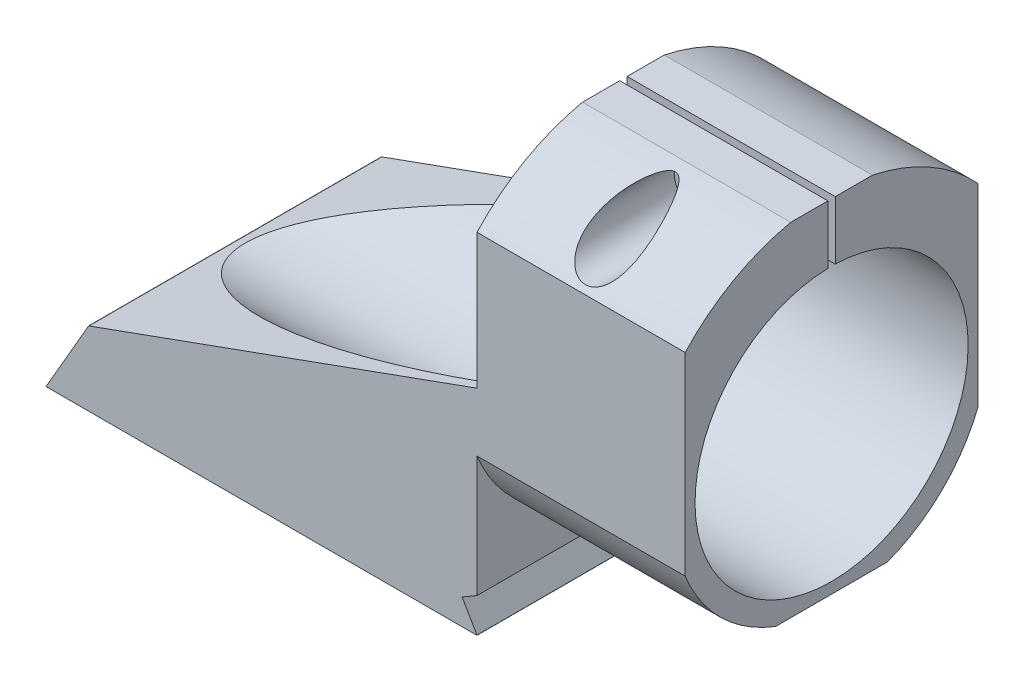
ISO-10303-21;
HEADER;
FILE_DESCRIPTION(('STEP AP214'),'2;1');
FILE_NAME('part.step','',(''),(''),'','','');
FILE_SCHEMA(('AUTOMOTIVE_DESIGN { 1 0 10303 214 1 1 1 1 }'));
ENDSEC;
DATA;
#1=APPLICATION_CONTEXT('core data for automotive mechanical design processes');
#2=APPLICATION_PROTOCOL_DEFINITION('international standard','automotive_design',2000,#1);
#3=PRODUCT_CONTEXT('',#1,'mechanical');
#4=PRODUCT('Part','Part','',(#3));
#5=PRODUCT_RELATED_PRODUCT_CATEGORY('part','',(#4));
#6=PRODUCT_DEFINITION_FORMATION('','',#4);
#7=PRODUCT_DEFINITION_CONTEXT('part definition',#1,'design');
#8=PRODUCT_DEFINITION('design','',#6,#7);
#9=PRODUCT_DEFINITION_SHAPE('','',#8);
#10=(LENGTH_UNIT() NAMED_UNIT(*) SI_UNIT(.MILLI.,.METRE.));
#11=(NAMED_UNIT(*) PLANE_ANGLE_UNIT() SI_UNIT($,.RADIAN.));
#12=(NAMED_UNIT(*) SI_UNIT($,.STERADIAN.) SOLID_ANGLE_UNIT());
#13=UNCERTAINTY_MEASURE_WITH_UNIT(LENGTH_MEASURE(1.E-05),#10,'distance_accuracy_value','');
#14=(GEOMETRIC_REPRESENTATION_CONTEXT(3) GLOBAL_UNCERTAINTY_ASSIGNED_CONTEXT((#13)) GLOBAL_UNIT_ASSIGNED_CONTEXT((#10,
#11,#12)) REPRESENTATION_CONTEXT('',''));
#15=CARTESIAN_POINT('',(0.,0.,0.));
#16=DIRECTION('',(0.,0.,1.));
#17=DIRECTION('',(1.,0.,0.));
#18=AXIS2_PLACEMENT_3D('',#15,#16,#17);
#19=CARTESIAN_POINT('',(86.6552160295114,49.0250236,0.));
#20=DIRECTION('',(-1.,0.,0.));
#21=DIRECTION('',(0.,0.,1.));
#22=AXIS2_PLACEMENT_3D('',#19,#20,#21);
#23=PLANE('',#22);
#24=CARTESIAN_POINT('',(86.6552160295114,29.0250118,-19.8501));
#25=DIRECTION('',(1.,0.,0.));
#26=DIRECTION('',(0.,0.,-1.));
#27=AXIS2_PLACEMENT_3D('',#24,#25,#26);
#28=CIRCLE('',#27,27.);
#29=CARTESIAN_POINT('',(86.6552160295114,55.4512236,-14.3133744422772));
#30=VERTEX_POINT('',#29);
#31=CARTESIAN_POINT('',(86.6552160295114,47.3272938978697,0.));
#32=VERTEX_POINT('',#31);
#33=EDGE_CURVE('E62',#30,#32,#28,.T.);
#34=ORIENTED_EDGE('',*,*,#33,.T.);
#35=DIRECTION('',(0.,-1.,0.));
#36=VECTOR('',#35,1.);
#37=CARTESIAN_POINT('',(86.6552160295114,49.0250236,0.));
#38=LINE('',#37,#36);
#39=CARTESIAN_POINT('',(86.6552160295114,21.066043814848,0.));
#40=VERTEX_POINT('',#39);
#41=EDGE_CURVE('E208',#32,#40,#38,.T.);
#42=ORIENTED_EDGE('',*,*,#41,.T.);
#43=CARTESIAN_POINT('',(86.6552160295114,29.0250118,-19.8501));
#44=DIRECTION('',(1.,0.,0.));
#45=DIRECTION('',(0.,0.,-1.));
#46=AXIS2_PLACEMENT_3D('',#43,#44,#45);
#47=CIRCLE('',#46,21.3862488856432);
#48=CARTESIAN_POINT('',(86.6552160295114,9.025,-12.2757241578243));
#49=VERTEX_POINT('',#48);
#50=EDGE_CURVE('E714',#40,#49,#47,.T.);
#51=ORIENTED_EDGE('',*,*,#50,.T.);
#52=DIRECTION('',(0.,0.,1.));
#53=VECTOR('',#52,1.);
#54=CARTESIAN_POINT('',(86.6552160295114,9.025,0.));
#55=LINE('',#54,#53);
#56=CARTESIAN_POINT('',(86.6552160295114,9.025,-27.4244758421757));
#57=VERTEX_POINT('',#56);
#58=EDGE_CURVE('E366',#57,#49,#55,.T.);
#59=ORIENTED_EDGE('',*,*,#58,.F.);
#60=CARTESIAN_POINT('',(86.6552160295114,21.066043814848,-39.7002));
#61=VERTEX_POINT('',#60);
#62=EDGE_CURVE('E717',#57,#61,#47,.T.);
#63=ORIENTED_EDGE('',*,*,#62,.T.);
#64=DIRECTION('',(0.,-1.,0.));
#65=VECTOR('',#64,1.);
#66=CARTESIAN_POINT('',(86.6552160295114,49.0250236,-39.7002));
#67=LINE('',#66,#65);
#68=CARTESIAN_POINT('',(86.6552160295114,47.3272938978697,-39.7002));
#69=VERTEX_POINT('',#68);
#70=EDGE_CURVE('E369',#69,#61,#67,.T.);
#71=ORIENTED_EDGE('',*,*,#70,.F.);
#72=CARTESIAN_POINT('',(86.6552160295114,55.4512236,-25.3868255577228));
#73=VERTEX_POINT('',#72);
#74=EDGE_CURVE('E724',#69,#73,#28,.T.);
#75=ORIENTED_EDGE('',*,*,#74,.T.);
#76=DIRECTION('',(0.,0.,-1.));
#77=VECTOR('',#76,1.);
#78=CARTESIAN_POINT('',(86.6552160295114,55.4512236,0.));
#79=LINE('',#78,#77);
#80=CARTESIAN_POINT('',(86.6552160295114,55.4512236,-20.3501));
#81=VERTEX_POINT('',#80);
#82=EDGE_CURVE('E243',#81,#73,#79,.T.);
#83=ORIENTED_EDGE('',*,*,#82,.F.);
#84=DIRECTION('',(0.,1.,0.));
#85=VECTOR('',#84,1.);
#86=CARTESIAN_POINT('',(86.6552160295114,-0.001000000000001,-20.3501));
#87=LINE('',#86,#85);
#88=CARTESIAN_POINT('',(86.6552160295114,47.5307583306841,-20.3501));
#89=VERTEX_POINT('',#88);
#90=EDGE_CURVE('E249',#89,#81,#87,.T.);
#91=ORIENTED_EDGE('',*,*,#90,.F.);
#92=CARTESIAN_POINT('',(86.6552160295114,29.0250118,-19.8501));
#93=DIRECTION('',(1.,0.,0.));
#94=DIRECTION('',(0.,0.,-1.));
#95=AXIS2_PLACEMENT_3D('',#92,#93,#94);
#96=CIRCLE('',#95,18.512499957);
#97=CARTESIAN_POINT('',(86.6552160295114,47.5307583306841,-19.3501));
#98=VERTEX_POINT('',#97);
#99=EDGE_CURVE('E359',#98,#89,#96,.T.);
#100=ORIENTED_EDGE('',*,*,#99,.F.);
#101=DIRECTION('',(0.,1.,0.));
#102=VECTOR('',#101,1.);
#103=CARTESIAN_POINT('',(86.6552160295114,-0.001000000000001,-19.3501));
#104=LINE('',#103,#102);
#105=CARTESIAN_POINT('',(86.6552160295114,55.4512236,-19.3501));
#106=VERTEX_POINT('',#105);
#107=EDGE_CURVE('E362',#98,#106,#104,.T.);
#108=ORIENTED_EDGE('',*,*,#107,.T.);
#109=EDGE_CURVE('E251',#30,#106,#79,.T.);
#110=ORIENTED_EDGE('',*,*,#109,.F.);
#111=EDGE_LOOP('',(#34,#42,#51,#59,#63,#71,#75,#83,#91,#100,#108,#110));
#112=FACE_BOUND('',#111,.T.);
#113=ADVANCED_FACE('F41',(#112),#23,.F.);
#114=CARTESIAN_POINT('',(86.6552160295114,49.0250236,-39.7002));
#115=DIRECTION('',(0.,0.,-1.));
#116=DIRECTION('',(-1.,0.,0.));
#117=AXIS2_PLACEMENT_3D('',#114,#115,#116);
#118=PLANE('',#117);
#119=DIRECTION('',(0.,-1.,0.));
#120=VECTOR('',#119,1.);
#121=CARTESIAN_POINT('',(58.4322160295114,0.,-39.7002));
#122=LINE('',#121,#120);
#123=CARTESIAN_POINT('',(58.4322160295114,47.3272938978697,-39.7002));
#124=VERTEX_POINT('',#123);
#125=CARTESIAN_POINT('',(58.4322160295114,29.0250236,-39.7002));
#126=VERTEX_POINT('',#125);
#127=EDGE_CURVE('E226',#124,#126,#122,.T.);
#128=ORIENTED_EDGE('',*,*,#127,.F.);
#129=DIRECTION('',(1.,0.,0.));
#130=VECTOR('',#129,1.);
#131=CARTESIAN_POINT('',(-20.1585179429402,47.3272938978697,-39.7002));
#132=LINE('',#131,#130);
#133=EDGE_CURVE('E209',#124,#69,#132,.T.);
#134=ORIENTED_EDGE('',*,*,#133,.T.);
#135=ORIENTED_EDGE('',*,*,#70,.T.);
#136=DIRECTION('',(1.,0.,0.));
#137=VECTOR('',#136,1.);
#138=CARTESIAN_POINT('',(-10.4475927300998,21.066043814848,-39.7002));
#139=LINE('',#138,#137);
#140=CARTESIAN_POINT('',(58.4322160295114,21.066043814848,-39.7002));
#141=VERTEX_POINT('',#140);
#142=EDGE_CURVE('E709',#141,#61,#139,.T.);
#143=ORIENTED_EDGE('',*,*,#142,.F.);
#144=DIRECTION('',(0.,1.,0.));
#145=VECTOR('',#144,1.);
#146=CARTESIAN_POINT('',(58.4322160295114,9.525,-39.7002));
#147=LINE('',#146,#145);
#148=CARTESIAN_POINT('',(58.4322160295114,4.6736,-39.7002));
#149=VERTEX_POINT('',#148);
#150=EDGE_CURVE('E274',#149,#141,#147,.T.);
#151=ORIENTED_EDGE('',*,*,#150,.F.);
#152=DIRECTION('',(0.864609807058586,0.502443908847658,0.));
#153=VECTOR('',#152,1.);
#154=CARTESIAN_POINT('',(58.4322160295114,4.6736,-39.7002));
#155=LINE('',#154,#153);
#156=CARTESIAN_POINT('',(56.4117958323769,3.4994890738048,-39.7002));
#157=VERTEX_POINT('',#156);
#158=EDGE_CURVE('E276',#157,#149,#155,.T.);
#159=ORIENTED_EDGE('',*,*,#158,.F.);
#160=DIRECTION('',(-0.502439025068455,0.8646126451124,0.));
#161=VECTOR('',#160,1.);
#162=CARTESIAN_POINT('',(56.4117958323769,3.4994890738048,-39.7002));
#163=LINE('',#162,#161);
#164=CARTESIAN_POINT('',(58.4322160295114,0.0226873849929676,-39.7002));
#165=VERTEX_POINT('',#164);
#166=EDGE_CURVE('E310',#165,#157,#163,.T.);
#167=ORIENTED_EDGE('',*,*,#166,.F.);
#168=DIRECTION('',(0.,-1.,0.));
#169=VECTOR('',#168,1.);
#170=CARTESIAN_POINT('',(58.4322160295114,49.0250236,-39.7002));
#171=LINE('',#170,#169);
#172=CARTESIAN_POINT('',(58.4322160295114,0.,-39.7002));
#173=VERTEX_POINT('',#172);
#174=EDGE_CURVE('E319',#165,#173,#171,.T.);
#175=ORIENTED_EDGE('',*,*,#174,.T.);
#176=DIRECTION('',(1.,0.,0.));
#177=VECTOR('',#176,1.);
#178=CARTESIAN_POINT('',(0.,0.,-39.7002));
#179=LINE('',#178,#177);
#180=CARTESIAN_POINT('',(0.,0.,-39.7002));
#181=VERTEX_POINT('',#180);
#182=EDGE_CURVE('E312',#181,#173,#179,.T.);
#183=ORIENTED_EDGE('',*,*,#182,.F.);
#184=DIRECTION('',(-0.499955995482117,-0.866050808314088,0.));
#185=VECTOR('',#184,1.);
#186=CARTESIAN_POINT('',(0.,0.,-39.7002));
#187=LINE('',#186,#185);
#188=CARTESIAN_POINT('',(5.7872572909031,10.025,-39.7002));
#189=VERTEX_POINT('',#188);
#190=EDGE_CURVE('E281',#189,#181,#187,.T.);
#191=ORIENTED_EDGE('',*,*,#190,.F.);
#192=DIRECTION('',(-1.,0.,0.));
#193=VECTOR('',#192,1.);
#194=CARTESIAN_POINT('',(5.49861602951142,10.025,-39.7002));
#195=LINE('',#194,#193);
#196=CARTESIAN_POINT('',(5.81861602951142,10.025,-39.7002));
#197=VERTEX_POINT('',#196);
#198=EDGE_CURVE('E238',#197,#189,#195,.T.);
#199=ORIENTED_EDGE('',*,*,#198,.F.);
#200=DIRECTION('',(-0.94055008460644,-0.339655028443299,0.));
#201=VECTOR('',#200,1.);
#202=CARTESIAN_POINT('',(-2.53134445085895,7.00963047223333,-39.7002));
#203=LINE('',#202,#201);
#204=EDGE_CURVE('E224',#126,#197,#203,.T.);
#205=ORIENTED_EDGE('',*,*,#204,.F.);
#206=EDGE_LOOP('',(#128,#134,#135,#143,#151,#159,#167,#175,#183,#191,#199,#205));
#207=FACE_BOUND('',#206,.T.);
#208=ADVANCED_FACE('F308',(#207),#118,.T.);
#209=CARTESIAN_POINT('',(86.6552160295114,49.0250236,0.));
#210=DIRECTION('',(0.,0.,-1.));
#211=DIRECTION('',(-1.,0.,0.));
#212=AXIS2_PLACEMENT_3D('',#209,#210,#211);
#213=PLANE('',#212);
#214=DIRECTION('',(1.,0.,0.));
#215=VECTOR('',#214,1.);
#216=CARTESIAN_POINT('',(-20.1585179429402,47.3272938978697,0.));
#217=LINE('',#216,#215);
#218=CARTESIAN_POINT('',(58.4322160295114,47.3272938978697,0.));
#219=VERTEX_POINT('',#218);
#220=EDGE_CURVE('E194',#219,#32,#217,.T.);
#221=ORIENTED_EDGE('',*,*,#220,.F.);
#222=DIRECTION('',(0.,1.,0.));
#223=VECTOR('',#222,1.);
#224=CARTESIAN_POINT('',(58.4322160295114,29.0250236,0.));
#225=LINE('',#224,#223);
#226=CARTESIAN_POINT('',(58.4322160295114,29.0250236,0.));
#227=VERTEX_POINT('',#226);
#228=EDGE_CURVE('E206',#227,#219,#225,.T.);
#229=ORIENTED_EDGE('',*,*,#228,.F.);
#230=DIRECTION('',(0.94055008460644,0.339655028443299,0.));
#231=VECTOR('',#230,1.);
#232=CARTESIAN_POINT('',(5.81861602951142,10.025,0.));
#233=LINE('',#232,#231);
#234=CARTESIAN_POINT('',(5.81861602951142,10.025,0.));
#235=VERTEX_POINT('',#234);
#236=EDGE_CURVE('E215',#235,#227,#233,.T.);
#237=ORIENTED_EDGE('',*,*,#236,.F.);
#238=DIRECTION('',(1.,0.,0.));
#239=VECTOR('',#238,1.);
#240=CARTESIAN_POINT('',(5.49861602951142,10.025,0.));
#241=LINE('',#240,#239);
#242=CARTESIAN_POINT('',(5.7872572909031,10.025,0.));
#243=VERTEX_POINT('',#242);
#244=EDGE_CURVE('E231',#243,#235,#241,.T.);
#245=ORIENTED_EDGE('',*,*,#244,.F.);
#246=DIRECTION('',(-0.499955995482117,-0.866050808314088,0.));
#247=VECTOR('',#246,1.);
#248=CARTESIAN_POINT('',(0.,0.,0.));
#249=LINE('',#248,#247);
#250=CARTESIAN_POINT('',(0.,0.,0.));
#251=VERTEX_POINT('',#250);
#252=EDGE_CURVE('E283',#243,#251,#249,.T.);
#253=ORIENTED_EDGE('',*,*,#252,.T.);
#254=DIRECTION('',(1.,0.,0.));
#255=VECTOR('',#254,1.);
#256=CARTESIAN_POINT('',(0.,0.,0.));
#257=LINE('',#256,#255);
#258=CARTESIAN_POINT('',(58.4322160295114,0.,0.));
#259=VERTEX_POINT('',#258);
#260=EDGE_CURVE('E288',#251,#259,#257,.T.);
#261=ORIENTED_EDGE('',*,*,#260,.T.);
#262=DIRECTION('',(0.,-1.,0.));
#263=VECTOR('',#262,1.);
#264=CARTESIAN_POINT('',(58.4322160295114,49.0250236,0.));
#265=LINE('',#264,#263);
#266=CARTESIAN_POINT('',(58.4322160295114,0.0226873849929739,0.));
#267=VERTEX_POINT('',#266);
#268=EDGE_CURVE('E324',#267,#259,#265,.T.);
#269=ORIENTED_EDGE('',*,*,#268,.F.);
#270=DIRECTION('',(-0.502439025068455,0.8646126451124,0.));
#271=VECTOR('',#270,1.);
#272=CARTESIAN_POINT('',(56.4117958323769,3.4994890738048,0.));
#273=LINE('',#272,#271);
#274=CARTESIAN_POINT('',(56.4117958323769,3.4994890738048,0.));
#275=VERTEX_POINT('',#274);
#276=EDGE_CURVE('E292',#267,#275,#273,.T.);
#277=ORIENTED_EDGE('',*,*,#276,.T.);
#278=DIRECTION('',(0.864609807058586,0.502443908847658,0.));
#279=VECTOR('',#278,1.);
#280=CARTESIAN_POINT('',(58.4322160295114,4.6736,0.));
#281=LINE('',#280,#279);
#282=CARTESIAN_POINT('',(58.4322160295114,4.6736,0.));
#283=VERTEX_POINT('',#282);
#284=EDGE_CURVE('E270',#275,#283,#281,.T.);
#285=ORIENTED_EDGE('',*,*,#284,.T.);
#286=DIRECTION('',(0.,1.,0.));
#287=VECTOR('',#286,1.);
#288=CARTESIAN_POINT('',(58.4322160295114,9.525,0.));
#289=LINE('',#288,#287);
#290=CARTESIAN_POINT('',(58.4322160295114,21.066043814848,0.));
#291=VERTEX_POINT('',#290);
#292=EDGE_CURVE('E279',#283,#291,#289,.T.);
#293=ORIENTED_EDGE('',*,*,#292,.T.);
#294=DIRECTION('',(1.,0.,0.));
#295=VECTOR('',#294,1.);
#296=CARTESIAN_POINT('',(-10.4475927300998,21.066043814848,0.));
#297=LINE('',#296,#295);
#298=EDGE_CURVE('E713',#291,#40,#297,.T.);
#299=ORIENTED_EDGE('',*,*,#298,.T.);
#300=ORIENTED_EDGE('',*,*,#41,.F.);
#301=EDGE_LOOP('',(#221,#229,#237,#245,#253,#261,#269,#277,#285,#293,#299,#300));
#302=FACE_BOUND('',#301,.T.);
#303=ADVANCED_FACE('F204',(#302),#213,.F.);
#304=CARTESIAN_POINT('',(58.4322160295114,29.0250236,-39.70025));
#305=DIRECTION('',(1.,0.,0.));
#306=DIRECTION('',(0.,0.,-1.));
#307=AXIS2_PLACEMENT_3D('',#304,#305,#306);
#308=PLANE('',#307);
#309=CARTESIAN_POINT('',(58.4322160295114,29.0250118,-19.8501));
#310=DIRECTION('',(1.,0.,0.));
#311=DIRECTION('',(0.,0.,-1.));
#312=AXIS2_PLACEMENT_3D('',#309,#310,#311);
#313=CIRCLE('',#312,27.);
#314=CARTESIAN_POINT('',(58.4322160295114,55.4512236,-14.3133744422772));
#315=VERTEX_POINT('',#314);
#316=EDGE_CURVE('E191',#219,#315,#313,.F.);
#317=ORIENTED_EDGE('',*,*,#316,.T.);
#318=DIRECTION('',(0.,0.,1.));
#319=VECTOR('',#318,1.);
#320=CARTESIAN_POINT('',(58.4322160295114,55.4512236,0.));
#321=LINE('',#320,#319);
#322=CARTESIAN_POINT('',(58.4322160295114,55.4512236,-19.3501));
#323=VERTEX_POINT('',#322);
#324=EDGE_CURVE('E383',#323,#315,#321,.T.);
#325=ORIENTED_EDGE('',*,*,#324,.F.);
#326=DIRECTION('',(0.,1.,0.));
#327=VECTOR('',#326,1.);
#328=CARTESIAN_POINT('',(58.4322160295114,-0.001000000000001,-19.3501));
#329=LINE('',#328,#327);
#330=CARTESIAN_POINT('',(58.4322160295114,47.5307583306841,-19.3501));
#331=VERTEX_POINT('',#330);
#332=EDGE_CURVE('E355',#331,#323,#329,.T.);
#333=ORIENTED_EDGE('',*,*,#332,.F.);
#334=CARTESIAN_POINT('',(58.4322160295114,29.0250118,-19.8501));
#335=DIRECTION('',(1.,0.,0.));
#336=DIRECTION('',(0.,0.,-1.));
#337=AXIS2_PLACEMENT_3D('',#334,#335,#336);
#338=CIRCLE('',#337,18.512499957);
#339=CARTESIAN_POINT('',(58.4322160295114,29.0250236,-1.33760004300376));
#340=VERTEX_POINT('',#339);
#341=EDGE_CURVE('E253',#331,#340,#338,.T.);
#342=ORIENTED_EDGE('',*,*,#341,.T.);
#343=DIRECTION('',(0.,0.,1.));
#344=VECTOR('',#343,1.);
#345=CARTESIAN_POINT('',(58.4322160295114,29.0250236,-39.70025));
#346=LINE('',#345,#344);
#347=EDGE_CURVE('E213',#340,#227,#346,.T.);
#348=ORIENTED_EDGE('',*,*,#347,.T.);
#349=ORIENTED_EDGE('',*,*,#228,.T.);
#350=EDGE_LOOP('',(#317,#325,#333,#342,#348,#349));
#351=FACE_BOUND('',#350,.T.);
#352=ADVANCED_FACE('F211',(#351),#308,.F.);
#353=CARTESIAN_POINT('',(58.4322160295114,55.4512236,-25.3868255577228));
#354=VERTEX_POINT('',#353);
#355=EDGE_CURVE('E70',#354,#124,#313,.F.);
#356=ORIENTED_EDGE('',*,*,#355,.T.);
#357=ORIENTED_EDGE('',*,*,#127,.T.);
#358=CARTESIAN_POINT('',(58.4322160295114,29.0250236,-38.3625999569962));
#359=VERTEX_POINT('',#358);
#360=EDGE_CURVE('E217',#126,#359,#346,.T.);
#361=ORIENTED_EDGE('',*,*,#360,.T.);
#362=CARTESIAN_POINT('',(58.4322160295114,47.5307583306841,-20.3501));
#363=VERTEX_POINT('',#362);
#364=EDGE_CURVE('E239',#359,#363,#338,.T.);
#365=ORIENTED_EDGE('',*,*,#364,.T.);
#366=DIRECTION('',(0.,1.,0.));
#367=VECTOR('',#366,1.);
#368=CARTESIAN_POINT('',(58.4322160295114,-0.001000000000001,-20.3501));
#369=LINE('',#368,#367);
#370=CARTESIAN_POINT('',(58.4322160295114,55.4512236,-20.3501));
#371=VERTEX_POINT('',#370);
#372=EDGE_CURVE('E378',#363,#371,#369,.T.);
#373=ORIENTED_EDGE('',*,*,#372,.T.);
#374=EDGE_CURVE('E384',#354,#371,#321,.T.);
#375=ORIENTED_EDGE('',*,*,#374,.F.);
#376=EDGE_LOOP('',(#356,#357,#361,#365,#373,#375));
#377=FACE_BOUND('',#376,.T.);
#378=ADVANCED_FACE('F390',(#377),#308,.F.);
#379=CARTESIAN_POINT('',(86.6552160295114,55.4512236,0.));
#380=DIRECTION('',(0.,1.,0.));
#381=DIRECTION('',(0.,0.,1.));
#382=AXIS2_PLACEMENT_3D('',#379,#380,#381);
#383=PLANE('',#382);
#384=ORIENTED_EDGE('',*,*,#324,.T.);
#385=DIRECTION('',(1.,0.,0.));
#386=VECTOR('',#385,1.);
#387=CARTESIAN_POINT('',(-20.1585179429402,55.4512236,-14.3133744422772));
#388=LINE('',#387,#386);
#389=EDGE_CURVE('E195',#315,#30,#388,.T.);
#390=ORIENTED_EDGE('',*,*,#389,.T.);
#391=ORIENTED_EDGE('',*,*,#109,.T.);
#392=DIRECTION('',(-1.,0.,0.));
#393=VECTOR('',#392,1.);
#394=CARTESIAN_POINT('',(86.6552160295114,55.4512236,-19.3501));
#395=LINE('',#394,#393);
#396=EDGE_CURVE('E371',#106,#323,#395,.T.);
#397=ORIENTED_EDGE('',*,*,#396,.T.);
#398=EDGE_LOOP('',(#384,#390,#391,#397));
#399=FACE_BOUND('',#398,.T.);
#400=ADVANCED_FACE('F423',(#399),#383,.T.);
#401=ORIENTED_EDGE('',*,*,#82,.T.);
#402=DIRECTION('',(1.,0.,0.));
#403=VECTOR('',#402,1.);
#404=CARTESIAN_POINT('',(-20.1585179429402,55.4512236,-25.3868255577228));
#405=LINE('',#404,#403);
#406=EDGE_CURVE('E722',#73,#354,#405,.F.);
#407=ORIENTED_EDGE('',*,*,#406,.T.);
#408=ORIENTED_EDGE('',*,*,#374,.T.);
#409=DIRECTION('',(-1.,0.,0.));
#410=VECTOR('',#409,1.);
#411=CARTESIAN_POINT('',(86.6552160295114,55.4512236,-20.3501));
#412=LINE('',#411,#410);
#413=EDGE_CURVE('E12',#81,#371,#412,.T.);
#414=ORIENTED_EDGE('',*,*,#413,.F.);
#415=EDGE_LOOP('',(#401,#407,#408,#414));
#416=FACE_BOUND('',#415,.T.);
#417=ADVANCED_FACE('F426',(#416),#383,.T.);
#418=CARTESIAN_POINT('',(72.5437160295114,51.5142236,0.));
#419=DIRECTION('',(0.,0.,1.));
#420=DIRECTION('',(1.,0.,0.));
#421=AXIS2_PLACEMENT_3D('',#418,#419,#420);
#422=CYLINDRICAL_SURFACE('',#421,3.57251);
#423=CARTESIAN_POINT('',(72.5437160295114,51.5142236,-16.2052));
#424=DIRECTION('',(0.,0.,1.));
#425=DIRECTION('',(1.,0.,0.));
#426=AXIS2_PLACEMENT_3D('',#423,#424,#425);
#427=CIRCLE('',#426,3.57251);
#428=CARTESIAN_POINT('',(76.1162260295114,51.5142236,-16.2052));
#429=VERTEX_POINT('',#428);
#430=EDGE_CURVE('E347',#429,#429,#427,.T.);
#431=ORIENTED_EDGE('',*,*,#430,.F.);
#432=EDGE_LOOP('',(#431));
#433=FACE_BOUND('',#432,.T.);
#434=CARTESIAN_POINT('',(76.1162260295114,51.5142236,-4.90903736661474));
#435=CARTESIAN_POINT('',(76.1162268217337,51.3693340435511,-4.6909511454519));
#436=CARTESIAN_POINT('',(76.1074338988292,51.2212517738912,-4.47495209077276));
#437=CARTESIAN_POINT('',(76.0696746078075,50.9196151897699,-4.04837296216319));
#438=CARTESIAN_POINT('',(76.0406993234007,50.7660584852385,-3.83779532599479));
#439=CARTESIAN_POINT('',(75.9595809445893,50.4557783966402,-3.42485637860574));
#440=CARTESIAN_POINT('',(75.9075373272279,50.299071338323,-3.22246381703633));
#441=CARTESIAN_POINT('',(75.776642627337,49.9845210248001,-2.82768908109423));
#442=CARTESIAN_POINT('',(75.6978289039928,49.8266796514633,-2.63529338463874));
#443=CARTESIAN_POINT('',(75.5190429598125,49.5300313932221,-2.28332798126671));
#444=CARTESIAN_POINT('',(75.4221560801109,49.3909641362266,-2.12243166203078));
#445=CARTESIAN_POINT('',(75.2003131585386,49.1192229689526,-1.81500600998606));
#446=CARTESIAN_POINT('',(75.0753769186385,48.9865446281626,-1.66846664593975));
#447=CARTESIAN_POINT('',(74.8155346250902,48.7524159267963,-1.41494753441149));
#448=CARTESIAN_POINT('',(74.6848021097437,48.6492434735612,-1.30531971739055));
#449=CARTESIAN_POINT('',(74.4005188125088,48.4573631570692,-1.10435438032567));
#450=CARTESIAN_POINT('',(74.2469986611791,48.3686362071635,-1.01299268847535));
#451=CARTESIAN_POINT('',(73.9521127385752,48.2278498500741,-0.869609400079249));
#452=CARTESIAN_POINT('',(73.8146205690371,48.1720031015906,-0.813366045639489));
#453=CARTESIAN_POINT('',(73.5283625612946,48.0767833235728,-0.718070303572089));
#454=CARTESIAN_POINT('',(73.379603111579,48.0374010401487,-0.679008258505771));
#455=CARTESIAN_POINT('',(73.0736744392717,47.9777888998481,-0.620070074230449));
#456=CARTESIAN_POINT('',(72.9164641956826,47.9576634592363,-0.600298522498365));
#457=CARTESIAN_POINT('',(72.5995339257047,47.9386282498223,-0.58159426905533));
#458=CARTESIAN_POINT('',(72.4398146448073,47.9397122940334,-0.582655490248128));
#459=CARTESIAN_POINT('',(72.1376066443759,47.9619269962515,-0.60449217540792));
#460=CARTESIAN_POINT('',(71.994849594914,47.9812648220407,-0.623504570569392));
#461=CARTESIAN_POINT('',(71.7157019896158,48.0360832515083,-0.677707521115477));
#462=CARTESIAN_POINT('',(71.5793117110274,48.0715645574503,-0.712898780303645));
#463=CARTESIAN_POINT('',(71.3114517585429,48.1579136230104,-0.799223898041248));
#464=CARTESIAN_POINT('',(71.1802936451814,48.2092511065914,-0.850846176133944));
#465=CARTESIAN_POINT('',(70.9298330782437,48.3240468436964,-0.967463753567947));
#466=CARTESIAN_POINT('',(70.8105365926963,48.3875111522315,-1.03246573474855));
#467=CARTESIAN_POINT('',(70.5308373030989,48.5563407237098,-1.2074590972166));
#468=CARTESIAN_POINT('',(70.3779509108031,48.6672577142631,-1.32412509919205));
#469=CARTESIAN_POINT('',(70.0998990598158,48.9019711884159,-1.57617799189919));
#470=CARTESIAN_POINT('',(69.9747973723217,49.0257963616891,-1.71160681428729));
#471=CARTESIAN_POINT('',(69.7818141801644,49.244930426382,-1.95669373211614));
#472=CARTESIAN_POINT('',(69.7076967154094,49.3385877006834,-2.0630380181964));
#473=CARTESIAN_POINT('',(69.5719516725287,49.528013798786,-2.28172437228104));
#474=CARTESIAN_POINT('',(69.5103296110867,49.6237835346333,-2.39406906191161));
#475=CARTESIAN_POINT('',(69.3985622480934,49.8162166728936,-2.62371700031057));
#476=CARTESIAN_POINT('',(69.3484261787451,49.9128807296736,-2.74102414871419));
#477=CARTESIAN_POINT('',(69.2586870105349,50.1061183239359,-2.97969528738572));
#478=CARTESIAN_POINT('',(69.2190873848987,50.2026918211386,-3.10106060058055));
#479=CARTESIAN_POINT('',(69.1296869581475,50.4497899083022,-3.41724071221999));
#480=CARTESIAN_POINT('',(69.0869190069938,50.5997194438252,-3.61452428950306));
#481=CARTESIAN_POINT('',(69.0219117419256,50.8956150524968,-4.01536293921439));
#482=CARTESIAN_POINT('',(68.9996841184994,51.0415788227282,-4.21892151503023));
#483=CARTESIAN_POINT('',(68.9731102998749,51.3286570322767,-4.63133867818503));
#484=CARTESIAN_POINT('',(68.9688123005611,51.4697573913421,-4.84021003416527));
#485=CARTESIAN_POINT('',(68.9760523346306,51.7458832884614,-5.26156038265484));
#486=CARTESIAN_POINT('',(68.9875886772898,51.8809094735,-5.47403898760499));
#487=CARTESIAN_POINT('',(69.0347467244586,52.2156823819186,-6.01744052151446));
#488=CARTESIAN_POINT('',(69.0800173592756,52.4109568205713,-6.35029926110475));
#489=CARTESIAN_POINT('',(69.199136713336,52.785130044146,-7.02028397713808));
#490=CARTESIAN_POINT('',(69.2730062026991,52.9640168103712,-7.35741288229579));
#491=CARTESIAN_POINT('',(69.4030027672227,53.2194576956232,-7.86408671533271));
#492=CARTESIAN_POINT('',(69.4494799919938,53.3023831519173,-8.03297913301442));
#493=CARTESIAN_POINT('',(69.5486874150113,53.4640002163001,-8.37094882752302));
#494=CARTESIAN_POINT('',(69.601417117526,53.5426921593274,-8.54002608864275));
#495=CARTESIAN_POINT('',(69.7130524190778,53.6957686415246,-8.87794678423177));
#496=CARTESIAN_POINT('',(69.7719540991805,53.770155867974,-9.04679029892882));
#497=CARTESIAN_POINT('',(69.8960935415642,53.9146400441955,-9.38396265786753));
#498=CARTESIAN_POINT('',(69.9613304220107,53.9847375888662,-9.55229157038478));
#499=CARTESIAN_POINT('',(70.0754255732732,54.0977222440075,-9.83143643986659));
#500=CARTESIAN_POINT('',(70.1224024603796,54.1418241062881,-9.94253335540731));
#501=CARTESIAN_POINT('',(70.2195070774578,54.2280954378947,-10.1640944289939));
#502=CARTESIAN_POINT('',(70.2696346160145,54.2702650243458,-10.274558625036));
#503=CARTESIAN_POINT('',(70.3733897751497,54.3526929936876,-10.4947590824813));
#504=CARTESIAN_POINT('',(70.4270220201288,54.3929487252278,-10.6044941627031));
#505=CARTESIAN_POINT('',(70.5381242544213,54.4714277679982,-10.8227328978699));
#506=CARTESIAN_POINT('',(70.5955938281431,54.5096512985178,-10.9312366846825));
#507=CARTESIAN_POINT('',(70.7153419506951,54.5842214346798,-11.1472305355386));
#508=CARTESIAN_POINT('',(70.7776491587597,54.6205543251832,-11.2547095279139));
#509=CARTESIAN_POINT('',(70.9075954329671,54.6909201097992,-11.4671613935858));
#510=CARTESIAN_POINT('',(70.9752332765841,54.7249535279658,-11.5721348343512));
#511=CARTESIAN_POINT('',(71.117050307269,54.7904341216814,-11.7782546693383));
#512=CARTESIAN_POINT('',(71.1912217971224,54.8218842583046,-11.8794053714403));
#513=CARTESIAN_POINT('',(71.3480256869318,54.8817457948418,-12.0757973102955));
#514=CARTESIAN_POINT('',(71.4306449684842,54.9101617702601,-12.1710473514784));
#515=CARTESIAN_POINT('',(71.5921401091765,54.9585187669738,-12.3361592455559));
#516=CARTESIAN_POINT('',(71.6692210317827,54.9790771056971,-12.4075716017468));
#517=CARTESIAN_POINT('',(71.833346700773,55.0164007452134,-12.5389921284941));
#518=CARTESIAN_POINT('',(71.9203461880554,55.0331823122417,-12.599049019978));
#519=CARTESIAN_POINT('',(72.0651255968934,55.0549193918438,-12.677597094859));
#520=CARTESIAN_POINT('',(72.1189409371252,55.0618308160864,-12.7027553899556));
#521=CARTESIAN_POINT('',(72.2299425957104,55.0733636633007,-12.7449018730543));
#522=CARTESIAN_POINT('',(72.2871248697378,55.0779877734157,-12.7618996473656));
#523=CARTESIAN_POINT('',(72.4043961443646,55.0845021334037,-12.785885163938));
#524=CARTESIAN_POINT('',(72.4645089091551,55.0863639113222,-12.7927686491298));
#525=CARTESIAN_POINT('',(72.5849757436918,55.08700251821,-12.7951270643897));
#526=CARTESIAN_POINT('',(72.6453297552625,55.0857800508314,-12.7906045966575));
#527=CARTESIAN_POINT('',(72.7572488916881,55.0807366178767,-12.7720158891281));
#528=CARTESIAN_POINT('',(72.8090297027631,55.0772288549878,-12.7591004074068));
#529=CARTESIAN_POINT('',(72.9100972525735,55.0682593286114,-12.7262281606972));
#530=CARTESIAN_POINT('',(72.9593825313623,55.0627964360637,-12.7062673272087));
#531=CARTESIAN_POINT('',(73.0901721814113,55.0456857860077,-12.6441187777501));
#532=CARTESIAN_POINT('',(73.1687956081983,55.0324404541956,-12.5963665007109));
#533=CARTESIAN_POINT('',(73.3179789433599,55.0026572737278,-12.4904126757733));
#534=CARTESIAN_POINT('',(73.3885069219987,54.9861070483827,-12.4321719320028));
#535=CARTESIAN_POINT('',(73.5459244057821,54.9445484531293,-12.288024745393));
#536=CARTESIAN_POINT('',(73.6301139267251,54.9185873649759,-12.1994864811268));
#537=CARTESIAN_POINT('',(73.7895644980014,54.8635208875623,-12.0155135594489));
#538=CARTESIAN_POINT('',(73.8648065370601,54.8344090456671,-11.9200648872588));
#539=CARTESIAN_POINT('',(74.0087472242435,54.7734634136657,-11.7243504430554));
#540=CARTESIAN_POINT('',(74.077406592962,54.7416152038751,-11.6240605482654));
#541=CARTESIAN_POINT('',(74.2090685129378,54.6756843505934,-11.4207210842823));
#542=CARTESIAN_POINT('',(74.2720760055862,54.64160370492,-11.3176740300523));
#543=CARTESIAN_POINT('',(74.4196580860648,54.5562228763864,-11.0647757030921));
#544=CARTESIAN_POINT('',(74.5018257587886,54.5038311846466,-10.9138913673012));
#545=CARTESIAN_POINT('',(74.6585850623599,54.3950635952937,-10.6096120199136));
#546=CARTESIAN_POINT('',(74.7331739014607,54.338686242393,-10.456216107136));
#547=CARTESIAN_POINT('',(74.875915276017,54.2220233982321,-10.1476335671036));
#548=CARTESIAN_POINT('',(74.9440583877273,54.1617323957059,-9.99244467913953));
#549=CARTESIAN_POINT('',(75.0744400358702,54.0373912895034,-9.68107909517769));
#550=CARTESIAN_POINT('',(75.1366778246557,53.9733407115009,-9.52490227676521));
#551=CARTESIAN_POINT('',(75.2554807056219,53.8416697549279,-9.21232841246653));
#552=CARTESIAN_POINT('',(75.3120573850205,53.7740571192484,-9.05593250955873));
#553=CARTESIAN_POINT('',(75.4198492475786,53.6351682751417,-8.74291597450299));
#554=CARTESIAN_POINT('',(75.4710639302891,53.5638917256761,-8.58629532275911));
#555=CARTESIAN_POINT('',(75.61663723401,53.3447358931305,-8.11680815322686));
#556=CARTESIAN_POINT('',(75.7030596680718,53.1913808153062,-7.80396020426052));
#557=CARTESIAN_POINT('',(75.8311058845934,52.9182625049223,-7.27340809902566));
#558=CARTESIAN_POINT('',(75.8784021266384,52.8021321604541,-7.05517229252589));
#559=CARTESIAN_POINT('',(75.9611916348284,52.5628986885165,-6.62023012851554));
#560=CARTESIAN_POINT('',(75.996683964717,52.4397950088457,-6.4035238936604));
#561=CARTESIAN_POINT('',(76.0547742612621,52.1866666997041,-5.97204594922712));
#562=CARTESIAN_POINT('',(76.0773559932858,52.0566335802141,-5.75727700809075));
#563=CARTESIAN_POINT('',(76.1080810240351,51.7901267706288,-5.33070701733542));
#564=CARTESIAN_POINT('',(76.1162252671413,51.6536535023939,-5.11890577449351));
#565=CARTESIAN_POINT('',(76.1162260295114,51.5142236,-4.90903736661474));
#566=B_SPLINE_CURVE_WITH_KNOTS('',3,(#434,#435,#436,#437,#438,#439,#440,#441,#442,#443,#444,
#445,#446,#447,#448,#449,#450,#451,#452,#453,#454,#455,#456,#457,#458,#459,#460,#461,#462,#463,
#464,#465,#466,#467,#468,#469,#470,#471,#472,#473,#474,#475,#476,#477,#478,#479,#480,#481,#482,
#483,#484,#485,#486,#487,#488,#489,#490,#491,#492,#493,#494,#495,#496,#497,#498,#499,#500,#501,
#502,#503,#504,#505,#506,#507,#508,#509,#510,#511,#512,#513,#514,#515,#516,#517,#518,#519,#520,
#521,#522,#523,#524,#525,#526,#527,#528,#529,#530,#531,#532,#533,#534,#535,#536,#537,#538,#539,
#540,#541,#542,#543,#544,#545,#546,#547,#548,#549,#550,#551,#552,#553,#554,#555,#556,#557,#558,
#559,#560,#561,#562,#563,#564,#565),.UNSPECIFIED.,.T.,.F.,(4,2,2,2,2,2,2,2,2,2,2,2,2,2,2,2,2,2,
2,2,2,2,2,2,2,2,2,2,2,2,2,2,2,2,2,2,2,2,2,2,2,2,2,2,2,2,2,2,2,2,2,2,2,2,2,2,2,2,2,2,2,2,2,2,2,
4),(0.,0.785314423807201,1.57097600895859,2.35328207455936,3.13450084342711,3.83379986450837,
4.53260674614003,5.12856594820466,5.72373121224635,6.19790573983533,6.67181339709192,
7.14827639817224,7.62460041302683,8.05852931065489,8.49247708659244,8.94076543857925,
9.38927821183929,10.0516125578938,10.7154517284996,11.1945883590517,11.6739360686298,
12.1536677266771,12.6335573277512,13.3867311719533,14.1403334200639,14.8959600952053,
15.6515060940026,16.8154912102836,17.9803232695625,18.5616265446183,19.1428837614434,
19.7237741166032,20.3045837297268,20.6898271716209,21.0750472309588,21.4607862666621,
21.8464835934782,22.2346717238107,22.622771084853,23.0104191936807,23.3974742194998,
23.7180405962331,24.0371987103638,24.2160750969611,24.3947408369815,24.5752356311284,
24.7556892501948,24.9155030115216,25.0754092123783,25.3525949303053,25.630838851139,
26.0046458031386,26.379233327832,26.7559325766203,27.13229920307,27.6708568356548,
28.2096121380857,28.7491433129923,29.2887427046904,29.8272140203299,30.3657355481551,
31.4415539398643,32.196319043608,32.9511439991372,33.7069160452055,34.4626386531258),.UNSPECIFIED.);
#567=CARTESIAN_POINT('',(76.1162260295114,51.5142236,-4.90903736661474));
#568=VERTEX_POINT('',#567);
#569=EDGE_CURVE('E45',#568,#568,#566,.T.);
#570=ORIENTED_EDGE('',*,*,#569,.F.);
#571=EDGE_LOOP('',(#570));
#572=FACE_BOUND('',#571,.T.);
#573=ADVANCED_FACE('F454',(#433,#572),#422,.F.);
#574=CARTESIAN_POINT('',(0.,0.,-39.7002));
#575=DIRECTION('',(0.,-1.,0.));
#576=DIRECTION('',(0.,0.,-1.));
#577=AXIS2_PLACEMENT_3D('',#574,#575,#576);
#578=PLANE('',#577);
#579=ORIENTED_EDGE('',*,*,#182,.T.);
#580=DIRECTION('',(0.,0.,1.));
#581=VECTOR('',#580,1.);
#582=CARTESIAN_POINT('',(58.4322160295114,0.,-39.7002));
#583=LINE('',#582,#581);
#584=EDGE_CURVE('E323',#173,#259,#583,.T.);
#585=ORIENTED_EDGE('',*,*,#584,.T.);
#586=ORIENTED_EDGE('',*,*,#260,.F.);
#587=DIRECTION('',(0.,0.,1.));
#588=VECTOR('',#587,1.);
#589=CARTESIAN_POINT('',(0.,0.,-39.7002));
#590=LINE('',#589,#588);
#591=EDGE_CURVE('E267',#181,#251,#590,.T.);
#592=ORIENTED_EDGE('',*,*,#591,.F.);
#593=EDGE_LOOP('',(#579,#585,#586,#592));
#594=FACE_BOUND('',#593,.T.);
#595=ADVANCED_FACE('F322',(#594),#578,.T.);
#596=CARTESIAN_POINT('',(56.4117958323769,3.4994890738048,-39.7002));
#597=DIRECTION('',(0.8646126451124,0.502439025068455,0.));
#598=DIRECTION('',(-0.502439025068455,0.8646126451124,0.));
#599=AXIS2_PLACEMENT_3D('',#596,#597,#598);
#600=PLANE('',#599);
#601=ORIENTED_EDGE('',*,*,#276,.F.);
#602=DIRECTION('',(0.,0.,-1.));
#603=VECTOR('',#602,1.);
#604=CARTESIAN_POINT('',(58.4322160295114,0.0226873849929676,-39.7002));
#605=LINE('',#604,#603);
#606=EDGE_CURVE('E326',#267,#165,#605,.T.);
#607=ORIENTED_EDGE('',*,*,#606,.T.);
#608=ORIENTED_EDGE('',*,*,#166,.T.);
#609=DIRECTION('',(0.,0.,1.));
#610=VECTOR('',#609,1.);
#611=CARTESIAN_POINT('',(56.4117958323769,3.4994890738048,-39.7002));
#612=LINE('',#611,#610);
#613=EDGE_CURVE('E260',#157,#275,#612,.T.);
#614=ORIENTED_EDGE('',*,*,#613,.T.);
#615=EDGE_LOOP('',(#601,#607,#608,#614));
#616=FACE_BOUND('',#615,.T.);
#617=ADVANCED_FACE('F329',(#616),#600,.T.);
#618=CARTESIAN_POINT('',(86.6552160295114,9.025,0.));
#619=DIRECTION('',(0.,-1.,0.));
#620=DIRECTION('',(0.,0.,-1.));
#621=AXIS2_PLACEMENT_3D('',#618,#619,#620);
#622=PLANE('',#621);
#623=DIRECTION('',(0.,0.,-1.));
#624=VECTOR('',#623,1.);
#625=CARTESIAN_POINT('',(58.4322160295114,9.025,0.));
#626=LINE('',#625,#624);
#627=CARTESIAN_POINT('',(58.4322160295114,9.025,-12.2757241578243));
#628=VERTEX_POINT('',#627);
#629=CARTESIAN_POINT('',(58.4322160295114,9.025,-27.4244758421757));
#630=VERTEX_POINT('',#629);
#631=EDGE_CURVE('E380',#628,#630,#626,.T.);
#632=ORIENTED_EDGE('',*,*,#631,.T.);
#633=DIRECTION('',(1.,0.,0.));
#634=VECTOR('',#633,1.);
#635=CARTESIAN_POINT('',(-10.4475927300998,9.025,-27.4244758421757));
#636=LINE('',#635,#634);
#637=EDGE_CURVE('E338',#630,#57,#636,.T.);
#638=ORIENTED_EDGE('',*,*,#637,.T.);
#639=ORIENTED_EDGE('',*,*,#58,.T.);
#640=DIRECTION('',(1.,0.,0.));
#641=VECTOR('',#640,1.);
#642=CARTESIAN_POINT('',(-10.4475927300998,9.025,-12.2757241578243));
#643=LINE('',#642,#641);
#644=EDGE_CURVE('E335',#49,#628,#643,.F.);
#645=ORIENTED_EDGE('',*,*,#644,.T.);
#646=EDGE_LOOP('',(#632,#638,#639,#645));
#647=FACE_BOUND('',#646,.T.);
#648=ADVANCED_FACE('F403',(#647),#622,.T.);
#649=CARTESIAN_POINT('',(5.81861602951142,10.025,-39.70025));
#650=DIRECTION('',(0.339655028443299,-0.94055008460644,0.));
#651=DIRECTION('',(0.94055008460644,0.339655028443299,0.));
#652=AXIS2_PLACEMENT_3D('',#649,#650,#651);
#653=PLANE('',#652);
#654=ORIENTED_EDGE('',*,*,#347,.F.);
#655=CARTESIAN_POINT('',(58.4321833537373,29.0250118,-19.8501));
#656=DIRECTION('',(0.339655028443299,-0.94055008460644,0.));
#657=DIRECTION('',(0.94055008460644,0.339655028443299,0.));
#658=AXIS2_PLACEMENT_3D('',#655,#656,#657);
#659=ELLIPSE('',#658,54.5038300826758,18.512499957);
#660=EDGE_CURVE('E219',#340,#359,#659,.T.);
#661=ORIENTED_EDGE('',*,*,#660,.T.);
#662=ORIENTED_EDGE('',*,*,#360,.F.);
#663=ORIENTED_EDGE('',*,*,#204,.T.);
#664=DIRECTION('',(0.,0.,1.));
#665=VECTOR('',#664,1.);
#666=CARTESIAN_POINT('',(5.81861602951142,10.025,-39.7002));
#667=LINE('',#666,#665);
#668=EDGE_CURVE('E228',#197,#235,#667,.T.);
#669=ORIENTED_EDGE('',*,*,#668,.T.);
#670=ORIENTED_EDGE('',*,*,#236,.T.);
#671=EDGE_LOOP('',(#654,#661,#662,#663,#669,#670));
#672=FACE_BOUND('',#671,.T.);
#673=ADVANCED_FACE('F388',(#672),#653,.F.);
#674=CARTESIAN_POINT('',(0.,10.025,0.));
#675=DIRECTION('',(0.,1.,0.));
#676=DIRECTION('',(0.,0.,1.));
#677=AXIS2_PLACEMENT_3D('',#674,#675,#676);
#678=PLANE('',#677);
#679=DIRECTION('',(0.,0.,-1.));
#680=VECTOR('',#679,1.);
#681=CARTESIAN_POINT('',(5.7872572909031,10.025,0.));
#682=LINE('',#681,#680);
#683=EDGE_CURVE('E241',#243,#189,#682,.T.);
#684=ORIENTED_EDGE('',*,*,#683,.F.);
#685=ORIENTED_EDGE('',*,*,#244,.T.);
#686=ORIENTED_EDGE('',*,*,#668,.F.);
#687=ORIENTED_EDGE('',*,*,#198,.T.);
#688=EDGE_LOOP('',(#684,#685,#686,#687));
#689=FACE_BOUND('',#688,.T.);
#690=ADVANCED_FACE('F394',(#689),#678,.T.);
#691=CARTESIAN_POINT('',(58.4322160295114,4.6736,-39.7002));
#692=DIRECTION('',(0.502443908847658,-0.864609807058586,0.));
#693=DIRECTION('',(0.864609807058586,0.502443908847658,0.));
#694=AXIS2_PLACEMENT_3D('',#691,#692,#693);
#695=PLANE('',#694);
#696=ORIENTED_EDGE('',*,*,#284,.F.);
#697=ORIENTED_EDGE('',*,*,#613,.F.);
#698=ORIENTED_EDGE('',*,*,#158,.T.);
#699=DIRECTION('',(0.,0.,1.));
#700=VECTOR('',#699,1.);
#701=CARTESIAN_POINT('',(58.4322160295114,4.6736,-39.7002));
#702=LINE('',#701,#700);
#703=EDGE_CURVE('E256',#149,#283,#702,.T.);
#704=ORIENTED_EDGE('',*,*,#703,.T.);
#705=EDGE_LOOP('',(#696,#697,#698,#704));
#706=FACE_BOUND('',#705,.T.);
#707=ADVANCED_FACE('F301',(#706),#695,.T.);
#708=CARTESIAN_POINT('',(58.4322160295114,9.525,-39.7002));
#709=DIRECTION('',(1.,0.,0.));
#710=DIRECTION('',(0.,0.,-1.));
#711=AXIS2_PLACEMENT_3D('',#708,#709,#710);
#712=PLANE('',#711);
#713=ORIENTED_EDGE('',*,*,#150,.T.);
#714=CARTESIAN_POINT('',(58.4322160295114,29.0250118,-19.8501));
#715=DIRECTION('',(1.,0.,0.));
#716=DIRECTION('',(0.,0.,-1.));
#717=AXIS2_PLACEMENT_3D('',#714,#715,#716);
#718=CIRCLE('',#717,21.3862488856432);
#719=EDGE_CURVE('E327',#141,#630,#718,.F.);
#720=ORIENTED_EDGE('',*,*,#719,.T.);
#721=ORIENTED_EDGE('',*,*,#631,.F.);
#722=EDGE_CURVE('E711',#628,#291,#718,.F.);
#723=ORIENTED_EDGE('',*,*,#722,.T.);
#724=ORIENTED_EDGE('',*,*,#292,.F.);
#725=ORIENTED_EDGE('',*,*,#703,.F.);
#726=EDGE_LOOP('',(#713,#720,#721,#723,#724,#725));
#727=FACE_BOUND('',#726,.T.);
#728=ADVANCED_FACE('F401',(#727),#712,.T.);
#729=CARTESIAN_POINT('',(0.,0.,-39.7002));
#730=DIRECTION('',(-0.866050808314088,0.499955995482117,0.));
#731=DIRECTION('',(-0.499955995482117,-0.866050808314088,0.));
#732=AXIS2_PLACEMENT_3D('',#729,#730,#731);
#733=PLANE('',#732);
#734=ORIENTED_EDGE('',*,*,#252,.F.);
#735=ORIENTED_EDGE('',*,*,#683,.T.);
#736=ORIENTED_EDGE('',*,*,#190,.T.);
#737=ORIENTED_EDGE('',*,*,#591,.T.);
#738=EDGE_LOOP('',(#734,#735,#736,#737));
#739=FACE_BOUND('',#738,.T.);
#740=ADVANCED_FACE('F43',(#739),#733,.T.);
#741=CARTESIAN_POINT('',(86.6552160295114,-0.001000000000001,-19.3501));
#742=DIRECTION('',(0.,0.,1.));
#743=DIRECTION('',(1.,0.,0.));
#744=AXIS2_PLACEMENT_3D('',#741,#742,#743);
#745=PLANE('',#744);
#746=CARTESIAN_POINT('',(72.5437160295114,51.5142236,-19.3501));
#747=DIRECTION('',(0.,0.,1.));
#748=DIRECTION('',(1.,0.,0.));
#749=AXIS2_PLACEMENT_3D('',#746,#747,#748);
#750=CIRCLE('',#749,1.89865);
#751=CARTESIAN_POINT('',(74.4423660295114,51.5142236,-19.3501));
#752=VERTEX_POINT('',#751);
#753=EDGE_CURVE('E353',#752,#752,#750,.T.);
#754=ORIENTED_EDGE('',*,*,#753,.T.);
#755=EDGE_LOOP('',(#754));
#756=FACE_BOUND('',#755,.T.);
#757=DIRECTION('',(-1.,0.,0.));
#758=VECTOR('',#757,1.);
#759=CARTESIAN_POINT('',(86.6552160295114,47.5307583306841,-19.3501));
#760=LINE('',#759,#758);
#761=EDGE_CURVE('E373',#98,#331,#760,.T.);
#762=ORIENTED_EDGE('',*,*,#761,.T.);
#763=ORIENTED_EDGE('',*,*,#332,.T.);
#764=ORIENTED_EDGE('',*,*,#396,.F.);
#765=ORIENTED_EDGE('',*,*,#107,.F.);
#766=EDGE_LOOP('',(#762,#763,#764,#765));
#767=FACE_BOUND('',#766,.T.);
#768=ADVANCED_FACE('F428',(#756,#767),#745,.F.);
#769=CARTESIAN_POINT('',(86.6552160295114,29.0250118,-19.8501));
#770=DIRECTION('',(-1.,0.,0.));
#771=DIRECTION('',(0.,0.,1.));
#772=AXIS2_PLACEMENT_3D('',#769,#770,#771);
#773=CYLINDRICAL_SURFACE('',#772,18.512499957);
#774=DIRECTION('',(-1.,0.,0.));
#775=VECTOR('',#774,1.);
#776=CARTESIAN_POINT('',(86.6552160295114,47.5307583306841,-20.3501));
#777=LINE('',#776,#775);
#778=EDGE_CURVE('E54',#89,#363,#777,.T.);
#779=ORIENTED_EDGE('',*,*,#778,.T.);
#780=ORIENTED_EDGE('',*,*,#364,.F.);
#781=ORIENTED_EDGE('',*,*,#660,.F.);
#782=ORIENTED_EDGE('',*,*,#341,.F.);
#783=ORIENTED_EDGE('',*,*,#761,.F.);
#784=ORIENTED_EDGE('',*,*,#99,.T.);
#785=EDGE_LOOP('',(#779,#780,#781,#782,#783,#784));
#786=FACE_BOUND('',#785,.T.);
#787=ADVANCED_FACE('F431',(#786),#773,.F.);
#788=CARTESIAN_POINT('',(86.6552160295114,-0.001000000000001,-20.3501));
#789=DIRECTION('',(0.,0.,1.));
#790=DIRECTION('',(1.,0.,0.));
#791=AXIS2_PLACEMENT_3D('',#788,#789,#790);
#792=PLANE('',#791);
#793=CARTESIAN_POINT('',(72.5437160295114,51.5142236,-20.3501));
#794=DIRECTION('',(0.,0.,1.));
#795=DIRECTION('',(1.,0.,0.));
#796=AXIS2_PLACEMENT_3D('',#793,#794,#795);
#797=CIRCLE('',#796,1.35254999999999);
#798=CARTESIAN_POINT('',(73.8962660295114,51.5142236,-20.3501));
#799=VERTEX_POINT('',#798);
#800=EDGE_CURVE('E341',#799,#799,#797,.T.);
#801=ORIENTED_EDGE('',*,*,#800,.F.);
#802=EDGE_LOOP('',(#801));
#803=FACE_BOUND('',#802,.T.);
#804=ORIENTED_EDGE('',*,*,#413,.T.);
#805=ORIENTED_EDGE('',*,*,#372,.F.);
#806=ORIENTED_EDGE('',*,*,#778,.F.);
#807=ORIENTED_EDGE('',*,*,#90,.T.);
#808=EDGE_LOOP('',(#804,#805,#806,#807));
#809=FACE_BOUND('',#808,.T.);
#810=ADVANCED_FACE('F420',(#803,#809),#792,.T.);
#811=CARTESIAN_POINT('',(72.5437160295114,51.5142236,0.));
#812=DIRECTION('',(0.,0.,1.));
#813=DIRECTION('',(1.,0.,0.));
#814=AXIS2_PLACEMENT_3D('',#811,#812,#813);
#815=CYLINDRICAL_SURFACE('',#814,1.89865);
#816=ORIENTED_EDGE('',*,*,#753,.F.);
#817=EDGE_LOOP('',(#816));
#818=FACE_BOUND('',#817,.T.);
#819=CARTESIAN_POINT('',(72.5437160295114,51.5142236,-16.2052));
#820=DIRECTION('',(0.,0.,1.));
#821=DIRECTION('',(1.,0.,0.));
#822=AXIS2_PLACEMENT_3D('',#819,#820,#821);
#823=CIRCLE('',#822,1.89865);
#824=CARTESIAN_POINT('',(74.4423660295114,51.5142236,-16.2052));
#825=VERTEX_POINT('',#824);
#826=EDGE_CURVE('E350',#825,#825,#823,.T.);
#827=ORIENTED_EDGE('',*,*,#826,.T.);
#828=EDGE_LOOP('',(#827));
#829=FACE_BOUND('',#828,.T.);
#830=ADVANCED_FACE('F405',(#818,#829),#815,.F.);
#831=CARTESIAN_POINT('',(74.4423660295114,51.5142236,-16.2052));
#832=DIRECTION('',(0.,0.,-1.));
#833=DIRECTION('',(-1.,0.,0.));
#834=AXIS2_PLACEMENT_3D('',#831,#832,#833);
#835=PLANE('',#834);
#836=ORIENTED_EDGE('',*,*,#826,.F.);
#837=EDGE_LOOP('',(#836));
#838=FACE_BOUND('',#837,.T.);
#839=ORIENTED_EDGE('',*,*,#430,.T.);
#840=EDGE_LOOP('',(#839));
#841=FACE_BOUND('',#840,.T.);
#842=ADVANCED_FACE('F522',(#838,#841),#835,.F.);
#843=CARTESIAN_POINT('',(72.5437160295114,51.5142236,-25.3501));
#844=DIRECTION('',(0.,0.,1.));
#845=DIRECTION('',(1.,0.,0.));
#846=AXIS2_PLACEMENT_3D('',#843,#844,#845);
#847=CONICAL_SURFACE('',#846,1.35254999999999,1.02974425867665);
#848=CARTESIAN_POINT('',(72.5437160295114,51.5142236,-26.1627940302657));
#849=VERTEX_POINT('',#848);
#850=VERTEX_LOOP('',#849);
#851=FACE_BOUND('',#850,.T.);
#852=CARTESIAN_POINT('',(72.5437160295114,51.5142236,-25.3501));
#853=DIRECTION('',(0.,0.,1.));
#854=DIRECTION('',(1.,0.,0.));
#855=AXIS2_PLACEMENT_3D('',#852,#853,#854);
#856=CIRCLE('',#855,1.35254999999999);
#857=CARTESIAN_POINT('',(73.8962660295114,51.5142236,-25.3501));
#858=VERTEX_POINT('',#857);
#859=EDGE_CURVE('E344',#858,#858,#856,.T.);
#860=ORIENTED_EDGE('',*,*,#859,.T.);
#861=EDGE_LOOP('',(#860));
#862=FACE_BOUND('',#861,.T.);
#863=ADVANCED_FACE('F531',(#851,#862),#847,.F.);
#864=CARTESIAN_POINT('',(72.5437160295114,51.5142236,-20.3501));
#865=DIRECTION('',(0.,0.,1.));
#866=DIRECTION('',(1.,0.,0.));
#867=AXIS2_PLACEMENT_3D('',#864,#865,#866);
#868=CYLINDRICAL_SURFACE('',#867,1.35254999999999);
#869=ORIENTED_EDGE('',*,*,#859,.F.);
#870=EDGE_LOOP('',(#869));
#871=FACE_BOUND('',#870,.T.);
#872=ORIENTED_EDGE('',*,*,#800,.T.);
#873=EDGE_LOOP('',(#872));
#874=FACE_BOUND('',#873,.T.);
#875=ADVANCED_FACE('F544',(#871,#874),#868,.F.);
#876=CARTESIAN_POINT('',(58.4322160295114,29.0250236,-39.70025));
#877=DIRECTION('',(1.,0.,0.));
#878=DIRECTION('',(0.,0.,-1.));
#879=AXIS2_PLACEMENT_3D('',#876,#877,#878);
#880=PLANE('',#879);
#881=ORIENTED_EDGE('',*,*,#606,.F.);
#882=ORIENTED_EDGE('',*,*,#268,.T.);
#883=ORIENTED_EDGE('',*,*,#584,.F.);
#884=ORIENTED_EDGE('',*,*,#174,.F.);
#885=EDGE_LOOP('',(#881,#882,#883,#884));
#886=FACE_BOUND('',#885,.T.);
#887=ADVANCED_FACE('F554',(#886),#880,.T.);
#888=CARTESIAN_POINT('',(-10.4475927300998,29.0250118,-19.8501));
#889=DIRECTION('',(1.,0.,0.));
#890=DIRECTION('',(0.,0.,-1.));
#891=AXIS2_PLACEMENT_3D('',#888,#889,#890);
#892=CYLINDRICAL_SURFACE('',#891,21.3862488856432);
#893=ORIENTED_EDGE('',*,*,#50,.F.);
#894=ORIENTED_EDGE('',*,*,#298,.F.);
#895=ORIENTED_EDGE('',*,*,#722,.F.);
#896=ORIENTED_EDGE('',*,*,#644,.F.);
#897=EDGE_LOOP('',(#893,#894,#895,#896));
#898=FACE_BOUND('',#897,.T.);
#899=ADVANCED_FACE('F567',(#898),#892,.T.);
#900=ORIENTED_EDGE('',*,*,#719,.F.);
#901=ORIENTED_EDGE('',*,*,#142,.T.);
#902=ORIENTED_EDGE('',*,*,#62,.F.);
#903=ORIENTED_EDGE('',*,*,#637,.F.);
#904=EDGE_LOOP('',(#900,#901,#902,#903));
#905=FACE_BOUND('',#904,.T.);
#906=ADVANCED_FACE('F574',(#905),#892,.T.);
#907=CARTESIAN_POINT('',(-20.1585179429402,29.0250118,-19.8501));
#908=DIRECTION('',(1.,0.,0.));
#909=DIRECTION('',(0.,0.,-1.));
#910=AXIS2_PLACEMENT_3D('',#907,#908,#909);
#911=CYLINDRICAL_SURFACE('',#910,27.);
#912=ORIENTED_EDGE('',*,*,#569,.T.);
#913=EDGE_LOOP('',(#912));
#914=FACE_BOUND('',#913,.T.);
#915=ORIENTED_EDGE('',*,*,#220,.T.);
#916=ORIENTED_EDGE('',*,*,#33,.F.);
#917=ORIENTED_EDGE('',*,*,#389,.F.);
#918=ORIENTED_EDGE('',*,*,#316,.F.);
#919=EDGE_LOOP('',(#915,#916,#917,#918));
#920=FACE_BOUND('',#919,.T.);
#921=ADVANCED_FACE('F193',(#914,#920),#911,.T.);
#922=ORIENTED_EDGE('',*,*,#355,.F.);
#923=ORIENTED_EDGE('',*,*,#406,.F.);
#924=ORIENTED_EDGE('',*,*,#74,.F.);
#925=ORIENTED_EDGE('',*,*,#133,.F.);
#926=EDGE_LOOP('',(#922,#923,#924,#925));
#927=FACE_BOUND('',#926,.T.);
#928=ADVANCED_FACE('F588',(#927),#911,.T.);
#929=CLOSED_SHELL('',(#113,#208,#303,#352,#378,#400,#417,#573,#595,#617,#648,#673,#690,#707,
#728,#740,#768,#787,#810,#830,#842,#863,#875,#887,#899,#906,#921,#928));
#930=MANIFOLD_SOLID_BREP('B2',#929);
#931=ADVANCED_BREP_SHAPE_REPRESENTATION('',(#18,#930),#14);
#932=SHAPE_DEFINITION_REPRESENTATION(#9,#931);
ENDSEC;
END-ISO-10303-21;
